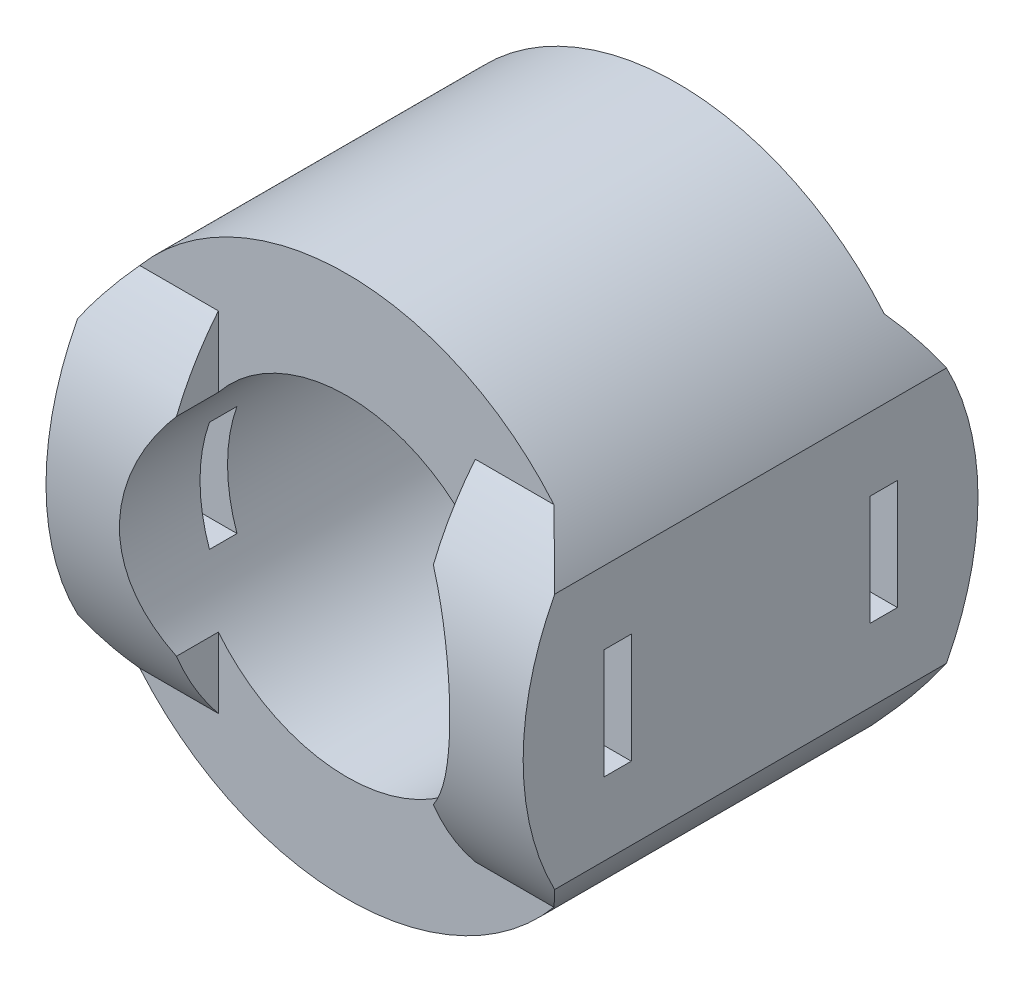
from build123d import *
from build123d.topology import SkipClean

# Parameters (mm, degrees)
ESQUISSE1_R                  = 18
BASE_EXTRUSION_DEPTH         = 36
BOSS_EXTRU_1_DEPTH           = 52
ENL_V_MAT_EXTRU_2_DEPTH      = 59.109282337
ESQUISSE5_R                  = 18
ENL_V_MAT_EXTRU_4_DEPTH      = 59.109282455
ENL_V_MAT_EXTRU_7_DEPTH      = 59.109282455
ENL_V_MAT_EXTRU_7_DEPTH_BACK = 59.109282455
ESQUISSE6_R                  = 32.202484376
ESQUISSE6_R_2                = 29.5
ESQUISSE7_W                  = 3
ESQUISSE7_H                  = 12
ENL_V_MAT_EXTRU_8_DEPTH      = 74.51658801


with BuildPart() as part:
    # Esquisse1 → Base-Extrusion (new body)
    with BuildSketch(Plane.XY):
        with BuildLine():
            Line((-26, 13.937359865), (-26, -13.937359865))
            ThreePointArc((-26, -13.937359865), (0, -29.5), (26, -13.937359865))
            Line((26, -13.937359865), (26, 13.937359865))
            ThreePointArc((26, 13.937359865), (0, 29.5), (-26, 13.937359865))
        make_face()
        with Locations(Location((0, 0, 0), (0, 0, 141.057558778))):
            Circle(ESQUISSE1_R, mode=Mode.SUBTRACT)
    extrude(amount=BASE_EXTRUSION_DEPTH)

    # Esquisse2 → Boss.-Extru.1 (add)
    with BuildSketch(Plane(origin=(26, 0, 0), x_dir=(0, 0, -1), z_dir=(1, 0, 0))):
        with BuildLine():
            Line((-36, -19), (-36, 19))
            ThreePointArc((-36, 19), (-42.783626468, 0), (-36, -19))
        make_face()
        with BuildLine():
            Line((0, -19), (0, 19))
            ThreePointArc((0, 19), (6.783626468, 0), (0, -19))
        make_face()
    extrude(amount=-BOSS_EXTRU_1_DEPTH)

    # Esquisse3 → Enl_v. mat.-Extru.2 (cut, through all)
    with SkipClean():  # the faces are left unmerged after this step: merging them gives an invalid solid
        with BuildSketch(Plane.XY.offset(36)):
            with BuildLine():
                Line((14, -11.313708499), (14, -25.966324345))
                Line((14, -25.966324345), (-14, -25.966324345))
                Line((-14, -25.966324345), (-14, -11.313708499))
                ThreePointArc((-14, -11.313708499), (-18, 0), (-14, 11.313708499))
                Line((-14, 11.313708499), (-14, 25.966324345))
                Line((-14, 25.966324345), (14, 25.966324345))
                Line((14, 25.966324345), (14, 11.313708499))
                ThreePointArc((14, 11.313708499), (18, 0), (14, -11.313708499))
            make_face()
        extrude(amount=ENL_V_MAT_EXTRU_2_DEPTH, mode=Mode.SUBTRACT)

    # Esquisse5 → Enl_v. mat.-Extru.4 (cut, through all)
    with SkipClean():  # the faces are left unmerged after this step: merging them gives an invalid solid
        with BuildSketch(Plane.XY):
            with Locations(Location((0, 0, 0), (0, 0, 141.057558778))):
                Circle(ESQUISSE5_R)
            with BuildLine():
                Line((14, 25.966324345), (-14, 25.966324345))
                Line((-14, 25.966324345), (-14, 11.313708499))
                ThreePointArc((-14, 11.313708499), (-18, 0), (-14, -11.313708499))
                Line((-14, -11.313708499), (-14, -25.966324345))
                Line((-14, -25.966324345), (14, -25.966324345))
                Line((14, -25.966324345), (14, -11.313708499))
                ThreePointArc((14, -11.313708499), (18, 0), (14, 11.313708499))
                Line((14, 11.313708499), (14, 25.966324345))
            make_face()
        extrude(amount=-ENL_V_MAT_EXTRU_4_DEPTH, mode=Mode.SUBTRACT)

    # Esquisse6 → Enl_v. mat.-Extru.7 (cut, two sides: drawn at the far end of the back side and taken through both)
    with BuildSketch(Plane(origin=(0, 0, 0), x_dir=(-1, 0, 0), z_dir=(0, 0, -1)).offset(-ENL_V_MAT_EXTRU_7_DEPTH_BACK)):
        Circle(ESQUISSE6_R)
        Circle(ESQUISSE6_R_2, mode=Mode.SUBTRACT)
    extrude(amount=ENL_V_MAT_EXTRU_7_DEPTH + ENL_V_MAT_EXTRU_7_DEPTH_BACK, mode=Mode.SUBTRACT)

    # Esquisse7 → Enl_v. mat.-Extru.8 (cut, through all)
    with BuildSketch(Plane.ZY.offset(26)):
        with Locations((32.5, 0)):
            Rectangle(ESQUISSE7_W, ESQUISSE7_H)
        with Locations((3.5, 0)):
            Rectangle(ESQUISSE7_W, ESQUISSE7_H)
    extrude(amount=-ENL_V_MAT_EXTRU_8_DEPTH, mode=Mode.SUBTRACT)


solid = part.part
